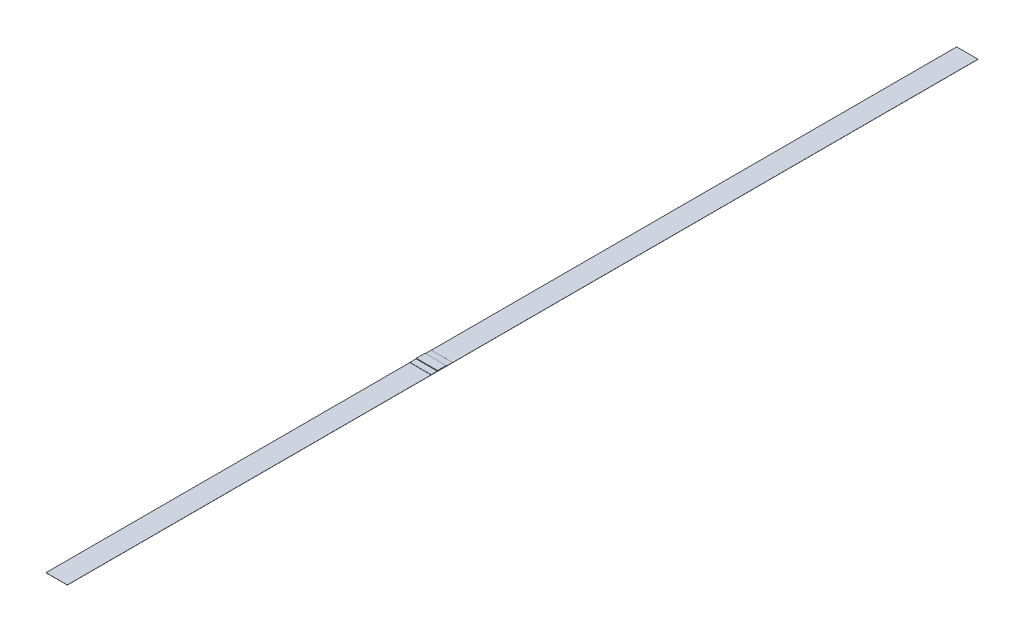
ISO-10303-21;
HEADER;
FILE_DESCRIPTION(('STEP AP214'),'2;1');
FILE_NAME('part.step','',(''),(''),'','','');
FILE_SCHEMA(('AUTOMOTIVE_DESIGN { 1 0 10303 214 1 1 1 1 }'));
ENDSEC;
DATA;
#1=APPLICATION_CONTEXT('core data for automotive mechanical design processes');
#2=APPLICATION_PROTOCOL_DEFINITION('international standard','automotive_design',2000,#1);
#3=PRODUCT_CONTEXT('',#1,'mechanical');
#4=PRODUCT('Part','Part','',(#3));
#5=PRODUCT_RELATED_PRODUCT_CATEGORY('part','',(#4));
#6=PRODUCT_DEFINITION_FORMATION('','',#4);
#7=PRODUCT_DEFINITION_CONTEXT('part definition',#1,'design');
#8=PRODUCT_DEFINITION('design','',#6,#7);
#9=PRODUCT_DEFINITION_SHAPE('','',#8);
#10=(LENGTH_UNIT() NAMED_UNIT(*) SI_UNIT(.MILLI.,.METRE.));
#11=(NAMED_UNIT(*) PLANE_ANGLE_UNIT() SI_UNIT($,.RADIAN.));
#12=(NAMED_UNIT(*) SI_UNIT($,.STERADIAN.) SOLID_ANGLE_UNIT());
#13=UNCERTAINTY_MEASURE_WITH_UNIT(LENGTH_MEASURE(1.E-05),#10,'distance_accuracy_value','');
#14=(GEOMETRIC_REPRESENTATION_CONTEXT(3) GLOBAL_UNCERTAINTY_ASSIGNED_CONTEXT((#13)) GLOBAL_UNIT_ASSIGNED_CONTEXT((#10,
#11,#12)) REPRESENTATION_CONTEXT('',''));
#15=CARTESIAN_POINT('',(0.,0.,0.));
#16=DIRECTION('',(0.,0.,1.));
#17=DIRECTION('',(1.,0.,0.));
#18=AXIS2_PLACEMENT_3D('',#15,#16,#17);
#19=CARTESIAN_POINT('',(0.,0.508,0.));
#20=DIRECTION('',(0.,1.,0.));
#21=DIRECTION('',(0.,0.,1.));
#22=AXIS2_PLACEMENT_3D('',#19,#20,#21);
#23=PLANE('',#22);
#24=DIRECTION('',(0.,0.,-1.));
#25=VECTOR('',#24,1.);
#26=CARTESIAN_POINT('',(66.675,0.508,0.));
#27=LINE('',#26,#25);
#28=CARTESIAN_POINT('',(66.675,0.508,-735.9015));
#29=VERTEX_POINT('',#28);
#30=CARTESIAN_POINT('',(66.675,0.508,-749.7445));
#31=VERTEX_POINT('',#30);
#32=EDGE_CURVE('E287',#29,#31,#27,.T.);
#33=ORIENTED_EDGE('',*,*,#32,.T.);
#34=DIRECTION('',(1.,0.,0.));
#35=VECTOR('',#34,1.);
#36=CARTESIAN_POINT('',(0.,0.508,-749.7445));
#37=LINE('',#36,#35);
#38=CARTESIAN_POINT('',(19.05,0.508,-749.7445));
#39=VERTEX_POINT('',#38);
#40=EDGE_CURVE('E253',#31,#39,#37,.F.);
#41=ORIENTED_EDGE('',*,*,#40,.T.);
#42=DIRECTION('',(0.,0.,1.));
#43=VECTOR('',#42,1.);
#44=CARTESIAN_POINT('',(19.05,0.508,0.));
#45=LINE('',#44,#43);
#46=CARTESIAN_POINT('',(19.05,0.508,-735.9015));
#47=VERTEX_POINT('',#46);
#48=EDGE_CURVE('E224',#39,#47,#45,.T.);
#49=ORIENTED_EDGE('',*,*,#48,.T.);
#50=DIRECTION('',(1.,0.,0.));
#51=VECTOR('',#50,1.);
#52=CARTESIAN_POINT('',(66.675,0.508,-735.9015));
#53=LINE('',#52,#51);
#54=EDGE_CURVE('E201',#47,#29,#53,.T.);
#55=ORIENTED_EDGE('',*,*,#54,.T.);
#56=EDGE_LOOP('',(#33,#41,#49,#55));
#57=FACE_BOUND('',#56,.T.);
#58=ADVANCED_FACE('F37',(#57),#23,.T.);
#59=CARTESIAN_POINT('',(19.05,0.508,-783.2725));
#60=VERTEX_POINT('',#59);
#61=CARTESIAN_POINT('',(19.05,0.508,-769.4295));
#62=VERTEX_POINT('',#61);
#63=EDGE_CURVE('E281',#60,#62,#45,.T.);
#64=ORIENTED_EDGE('',*,*,#63,.T.);
#65=DIRECTION('',(-1.,0.,0.));
#66=VECTOR('',#65,1.);
#67=CARTESIAN_POINT('',(0.,0.508,-769.4295));
#68=LINE('',#67,#66);
#69=CARTESIAN_POINT('',(66.675,0.508,-769.4295));
#70=VERTEX_POINT('',#69);
#71=EDGE_CURVE('E233',#62,#70,#68,.F.);
#72=ORIENTED_EDGE('',*,*,#71,.T.);
#73=CARTESIAN_POINT('',(66.675,0.508,-783.2725));
#74=VERTEX_POINT('',#73);
#75=EDGE_CURVE('E263',#70,#74,#27,.T.);
#76=ORIENTED_EDGE('',*,*,#75,.T.);
#77=DIRECTION('',(1.,0.,0.));
#78=VECTOR('',#77,1.);
#79=CARTESIAN_POINT('',(0.,0.508,-783.2725));
#80=LINE('',#79,#78);
#81=EDGE_CURVE('E204',#74,#60,#80,.F.);
#82=ORIENTED_EDGE('',*,*,#81,.T.);
#83=EDGE_LOOP('',(#64,#72,#76,#82));
#84=FACE_BOUND('',#83,.T.);
#85=ADVANCED_FACE('F284',(#84),#23,.T.);
#86=CARTESIAN_POINT('',(0.,0.254,0.));
#87=DIRECTION('',(0.,1.,0.));
#88=DIRECTION('',(0.,0.,1.));
#89=AXIS2_PLACEMENT_3D('',#86,#87,#88);
#90=PLANE('',#89);
#91=DIRECTION('',(0.,0.,-1.));
#92=VECTOR('',#91,1.);
#93=CARTESIAN_POINT('',(19.05,0.254,0.));
#94=LINE('',#93,#92);
#95=CARTESIAN_POINT('',(19.05,0.254,-783.5265));
#96=VERTEX_POINT('',#95);
#97=CARTESIAN_POINT('',(19.05,0.254,-1955.8));
#98=VERTEX_POINT('',#97);
#99=EDGE_CURVE('E294',#96,#98,#94,.T.);
#100=ORIENTED_EDGE('',*,*,#99,.F.);
#101=DIRECTION('',(1.,0.,0.));
#102=VECTOR('',#101,1.);
#103=CARTESIAN_POINT('',(66.675,0.254,-783.5265));
#104=LINE('',#103,#102);
#105=CARTESIAN_POINT('',(66.675,0.254,-783.5265));
#106=VERTEX_POINT('',#105);
#107=EDGE_CURVE('E187',#96,#106,#104,.T.);
#108=ORIENTED_EDGE('',*,*,#107,.T.);
#109=DIRECTION('',(0.,0.,-1.));
#110=VECTOR('',#109,1.);
#111=CARTESIAN_POINT('',(66.675,0.254,0.));
#112=LINE('',#111,#110);
#113=CARTESIAN_POINT('',(66.675,0.254,-1955.8));
#114=VERTEX_POINT('',#113);
#115=EDGE_CURVE('E173',#106,#114,#112,.T.);
#116=ORIENTED_EDGE('',*,*,#115,.T.);
#117=DIRECTION('',(1.,0.,0.));
#118=VECTOR('',#117,1.);
#119=CARTESIAN_POINT('',(0.,0.254,-1955.8));
#120=LINE('',#119,#118);
#121=EDGE_CURVE('E172',#98,#114,#120,.T.);
#122=ORIENTED_EDGE('',*,*,#121,.F.);
#123=EDGE_LOOP('',(#100,#108,#116,#122));
#124=FACE_BOUND('',#123,.T.);
#125=ADVANCED_FACE('F317',(#124),#90,.T.);
#126=CARTESIAN_POINT('',(0.,0.254,76.2));
#127=DIRECTION('',(0.,0.,-1.));
#128=DIRECTION('',(-1.,0.,0.));
#129=AXIS2_PLACEMENT_3D('',#126,#127,#128);
#130=PLANE('',#129);
#131=DIRECTION('',(1.,0.,0.));
#132=VECTOR('',#131,1.);
#133=CARTESIAN_POINT('',(0.,0.,76.2));
#134=LINE('',#133,#132);
#135=CARTESIAN_POINT('',(19.05,0.,76.2));
#136=VERTEX_POINT('',#135);
#137=CARTESIAN_POINT('',(66.675,0.,76.2));
#138=VERTEX_POINT('',#137);
#139=EDGE_CURVE('E186',#136,#138,#134,.T.);
#140=ORIENTED_EDGE('',*,*,#139,.T.);
#141=DIRECTION('',(0.,-1.,0.));
#142=VECTOR('',#141,1.);
#143=CARTESIAN_POINT('',(66.675,0.254,76.2));
#144=LINE('',#143,#142);
#145=CARTESIAN_POINT('',(66.675,0.254,76.2));
#146=VERTEX_POINT('',#145);
#147=EDGE_CURVE('E166',#146,#138,#144,.T.);
#148=ORIENTED_EDGE('',*,*,#147,.F.);
#149=DIRECTION('',(1.,0.,0.));
#150=VECTOR('',#149,1.);
#151=CARTESIAN_POINT('',(0.,0.254,76.2));
#152=LINE('',#151,#150);
#153=CARTESIAN_POINT('',(19.05,0.254,76.2));
#154=VERTEX_POINT('',#153);
#155=EDGE_CURVE('E177',#154,#146,#152,.T.);
#156=ORIENTED_EDGE('',*,*,#155,.F.);
#157=DIRECTION('',(0.,-1.,0.));
#158=VECTOR('',#157,1.);
#159=CARTESIAN_POINT('',(19.05,0.254,76.2));
#160=LINE('',#159,#158);
#161=EDGE_CURVE('E296',#154,#136,#160,.T.);
#162=ORIENTED_EDGE('',*,*,#161,.T.);
#163=EDGE_LOOP('',(#140,#148,#156,#162));
#164=FACE_BOUND('',#163,.T.);
#165=ADVANCED_FACE('F184',(#164),#130,.F.);
#166=CARTESIAN_POINT('',(66.675,0.254,0.));
#167=DIRECTION('',(-1.,0.,0.));
#168=DIRECTION('',(0.,0.,1.));
#169=AXIS2_PLACEMENT_3D('',#166,#167,#168);
#170=PLANE('',#169);
#171=DIRECTION('',(0.,-1.,0.));
#172=VECTOR('',#171,1.);
#173=CARTESIAN_POINT('',(66.675,1.524,-769.3025));
#174=LINE('',#173,#172);
#175=CARTESIAN_POINT('',(66.675,1.397,-769.3025));
#176=VERTEX_POINT('',#175);
#177=CARTESIAN_POINT('',(66.675,0.635,-769.3025));
#178=VERTEX_POINT('',#177);
#179=EDGE_CURVE('E261',#176,#178,#174,.T.);
#180=ORIENTED_EDGE('',*,*,#179,.F.);
#181=CARTESIAN_POINT('',(66.675,1.397,-769.1755));
#182=DIRECTION('',(-1.,0.,0.));
#183=DIRECTION('',(0.,0.,1.));
#184=AXIS2_PLACEMENT_3D('',#181,#182,#183);
#185=CIRCLE('',#184,0.127);
#186=CARTESIAN_POINT('',(66.675,1.524,-769.1755));
#187=VERTEX_POINT('',#186);
#188=EDGE_CURVE('E247',#176,#187,#185,.F.);
#189=ORIENTED_EDGE('',*,*,#188,.T.);
#190=DIRECTION('',(0.,0.,-1.));
#191=VECTOR('',#190,1.);
#192=CARTESIAN_POINT('',(66.675,1.524,-749.8715));
#193=LINE('',#192,#191);
#194=CARTESIAN_POINT('',(66.675,1.524,-749.9985));
#195=VERTEX_POINT('',#194);
#196=EDGE_CURVE('E458',#195,#187,#193,.T.);
#197=ORIENTED_EDGE('',*,*,#196,.F.);
#198=CARTESIAN_POINT('',(66.675,1.397,-749.9985));
#199=DIRECTION('',(-1.,0.,0.));
#200=DIRECTION('',(0.,0.,1.));
#201=AXIS2_PLACEMENT_3D('',#198,#199,#200);
#202=CIRCLE('',#201,0.127);
#203=CARTESIAN_POINT('',(66.675,1.397,-749.8715));
#204=VERTEX_POINT('',#203);
#205=EDGE_CURVE('E245',#195,#204,#202,.F.);
#206=ORIENTED_EDGE('',*,*,#205,.T.);
#207=DIRECTION('',(0.,-1.,0.));
#208=VECTOR('',#207,1.);
#209=CARTESIAN_POINT('',(66.675,1.524,-749.8715));
#210=LINE('',#209,#208);
#211=CARTESIAN_POINT('',(66.675,0.635,-749.8715));
#212=VERTEX_POINT('',#211);
#213=EDGE_CURVE('E272',#204,#212,#210,.T.);
#214=ORIENTED_EDGE('',*,*,#213,.T.);
#215=CARTESIAN_POINT('',(66.675,0.635,-749.7445));
#216=DIRECTION('',(-1.,0.,0.));
#217=DIRECTION('',(0.,0.,1.));
#218=AXIS2_PLACEMENT_3D('',#215,#216,#217);
#219=CIRCLE('',#218,0.127);
#220=EDGE_CURVE('E45',#212,#31,#219,.T.);
#221=ORIENTED_EDGE('',*,*,#220,.T.);
#222=ORIENTED_EDGE('',*,*,#32,.F.);
#223=CARTESIAN_POINT('',(66.675,0.381,-735.9015));
#224=DIRECTION('',(-1.,0.,0.));
#225=DIRECTION('',(0.,0.,1.));
#226=AXIS2_PLACEMENT_3D('',#223,#224,#225);
#227=CIRCLE('',#226,0.127);
#228=CARTESIAN_POINT('',(66.675,0.381,-735.7745));
#229=VERTEX_POINT('',#228);
#230=EDGE_CURVE('E191',#29,#229,#227,.F.);
#231=ORIENTED_EDGE('',*,*,#230,.T.);
#232=CARTESIAN_POINT('',(66.675,0.381,-735.6475));
#233=DIRECTION('',(-1.,0.,0.));
#234=DIRECTION('',(0.,0.,1.));
#235=AXIS2_PLACEMENT_3D('',#232,#233,#234);
#236=CIRCLE('',#235,0.127);
#237=CARTESIAN_POINT('',(66.675,0.254,-735.6475));
#238=VERTEX_POINT('',#237);
#239=EDGE_CURVE('E169',#229,#238,#236,.T.);
#240=ORIENTED_EDGE('',*,*,#239,.T.);
#241=EDGE_CURVE('E160',#146,#238,#112,.T.);
#242=ORIENTED_EDGE('',*,*,#241,.F.);
#243=ORIENTED_EDGE('',*,*,#147,.T.);
#244=DIRECTION('',(0.,0.,-1.));
#245=VECTOR('',#244,1.);
#246=CARTESIAN_POINT('',(66.675,0.,0.));
#247=LINE('',#246,#245);
#248=CARTESIAN_POINT('',(66.675,0.,-1955.8));
#249=VERTEX_POINT('',#248);
#250=EDGE_CURVE('E298',#138,#249,#247,.T.);
#251=ORIENTED_EDGE('',*,*,#250,.T.);
#252=DIRECTION('',(0.,-1.,0.));
#253=VECTOR('',#252,1.);
#254=CARTESIAN_POINT('',(66.675,0.254,-1955.8));
#255=LINE('',#254,#253);
#256=EDGE_CURVE('E188',#114,#249,#255,.T.);
#257=ORIENTED_EDGE('',*,*,#256,.F.);
#258=ORIENTED_EDGE('',*,*,#115,.F.);
#259=CARTESIAN_POINT('',(66.675,0.381,-783.5265));
#260=DIRECTION('',(-1.,0.,0.));
#261=DIRECTION('',(0.,0.,1.));
#262=AXIS2_PLACEMENT_3D('',#259,#260,#261);
#263=CIRCLE('',#262,0.127);
#264=CARTESIAN_POINT('',(66.675,0.381,-783.3995));
#265=VERTEX_POINT('',#264);
#266=EDGE_CURVE('E213',#106,#265,#263,.T.);
#267=ORIENTED_EDGE('',*,*,#266,.T.);
#268=CARTESIAN_POINT('',(66.675,0.381,-783.2725));
#269=DIRECTION('',(-1.,0.,0.));
#270=DIRECTION('',(0.,0.,1.));
#271=AXIS2_PLACEMENT_3D('',#268,#269,#270);
#272=CIRCLE('',#271,0.127);
#273=EDGE_CURVE('E198',#265,#74,#272,.F.);
#274=ORIENTED_EDGE('',*,*,#273,.T.);
#275=ORIENTED_EDGE('',*,*,#75,.F.);
#276=CARTESIAN_POINT('',(66.675,0.635,-769.4295));
#277=DIRECTION('',(-1.,0.,0.));
#278=DIRECTION('',(0.,0.,1.));
#279=AXIS2_PLACEMENT_3D('',#276,#277,#278);
#280=CIRCLE('',#279,0.127);
#281=EDGE_CURVE('E257',#70,#178,#280,.T.);
#282=ORIENTED_EDGE('',*,*,#281,.T.);
#283=EDGE_LOOP('',(#180,#189,#197,#206,#214,#221,#222,#231,#240,#242,#243,#251,#257,#258,#267,
#274,#275,#282));
#284=FACE_BOUND('',#283,.T.);
#285=ADVANCED_FACE('F163',(#284),#170,.F.);
#286=CARTESIAN_POINT('',(0.,0.254,-1955.8));
#287=DIRECTION('',(0.,0.,-1.));
#288=DIRECTION('',(-1.,0.,0.));
#289=AXIS2_PLACEMENT_3D('',#286,#287,#288);
#290=PLANE('',#289);
#291=DIRECTION('',(1.,0.,0.));
#292=VECTOR('',#291,1.);
#293=CARTESIAN_POINT('',(0.,0.,-1955.8));
#294=LINE('',#293,#292);
#295=CARTESIAN_POINT('',(19.05,0.,-1955.8));
#296=VERTEX_POINT('',#295);
#297=EDGE_CURVE('E300',#296,#249,#294,.T.);
#298=ORIENTED_EDGE('',*,*,#297,.F.);
#299=DIRECTION('',(0.,-1.,0.));
#300=VECTOR('',#299,1.);
#301=CARTESIAN_POINT('',(19.05,0.254,-1955.8));
#302=LINE('',#301,#300);
#303=EDGE_CURVE('E193',#98,#296,#302,.T.);
#304=ORIENTED_EDGE('',*,*,#303,.F.);
#305=ORIENTED_EDGE('',*,*,#121,.T.);
#306=ORIENTED_EDGE('',*,*,#256,.T.);
#307=EDGE_LOOP('',(#298,#304,#305,#306));
#308=FACE_BOUND('',#307,.T.);
#309=ADVANCED_FACE('F311',(#308),#290,.T.);
#310=CARTESIAN_POINT('',(19.05,0.254,0.));
#311=DIRECTION('',(-1.,0.,0.));
#312=DIRECTION('',(0.,0.,1.));
#313=AXIS2_PLACEMENT_3D('',#310,#311,#312);
#314=PLANE('',#313);
#315=DIRECTION('',(0.,0.,1.));
#316=VECTOR('',#315,1.);
#317=CARTESIAN_POINT('',(19.05,1.524,-749.8715));
#318=LINE('',#317,#316);
#319=CARTESIAN_POINT('',(19.05,1.524,-769.1755));
#320=VERTEX_POINT('',#319);
#321=CARTESIAN_POINT('',(19.05,1.524,-749.9985));
#322=VERTEX_POINT('',#321);
#323=EDGE_CURVE('E461',#320,#322,#318,.T.);
#324=ORIENTED_EDGE('',*,*,#323,.F.);
#325=CARTESIAN_POINT('',(19.05,1.397,-769.1755));
#326=DIRECTION('',(-1.,0.,0.));
#327=DIRECTION('',(0.,0.,1.));
#328=AXIS2_PLACEMENT_3D('',#325,#326,#327);
#329=CIRCLE('',#328,0.127);
#330=CARTESIAN_POINT('',(19.05,1.397,-769.3025));
#331=VERTEX_POINT('',#330);
#332=EDGE_CURVE('E243',#320,#331,#329,.T.);
#333=ORIENTED_EDGE('',*,*,#332,.T.);
#334=DIRECTION('',(0.,-1.,0.));
#335=VECTOR('',#334,1.);
#336=CARTESIAN_POINT('',(19.05,1.524,-769.3025));
#337=LINE('',#336,#335);
#338=CARTESIAN_POINT('',(19.05,0.635,-769.3025));
#339=VERTEX_POINT('',#338);
#340=EDGE_CURVE('E273',#331,#339,#337,.T.);
#341=ORIENTED_EDGE('',*,*,#340,.T.);
#342=CARTESIAN_POINT('',(19.05,0.635,-769.4295));
#343=DIRECTION('',(-1.,0.,0.));
#344=DIRECTION('',(0.,0.,1.));
#345=AXIS2_PLACEMENT_3D('',#342,#343,#344);
#346=CIRCLE('',#345,0.127);
#347=EDGE_CURVE('E255',#339,#62,#346,.F.);
#348=ORIENTED_EDGE('',*,*,#347,.T.);
#349=ORIENTED_EDGE('',*,*,#63,.F.);
#350=CARTESIAN_POINT('',(19.05,0.381,-783.2725));
#351=DIRECTION('',(-1.,0.,0.));
#352=DIRECTION('',(0.,0.,1.));
#353=AXIS2_PLACEMENT_3D('',#350,#351,#352);
#354=CIRCLE('',#353,0.127);
#355=CARTESIAN_POINT('',(19.05,0.381,-783.3995));
#356=VERTEX_POINT('',#355);
#357=EDGE_CURVE('E209',#60,#356,#354,.T.);
#358=ORIENTED_EDGE('',*,*,#357,.T.);
#359=CARTESIAN_POINT('',(19.05,0.381,-783.5265));
#360=DIRECTION('',(-1.,0.,0.));
#361=DIRECTION('',(0.,0.,1.));
#362=AXIS2_PLACEMENT_3D('',#359,#360,#361);
#363=CIRCLE('',#362,0.127);
#364=EDGE_CURVE('E215',#356,#96,#363,.F.);
#365=ORIENTED_EDGE('',*,*,#364,.T.);
#366=ORIENTED_EDGE('',*,*,#99,.T.);
#367=ORIENTED_EDGE('',*,*,#303,.T.);
#368=DIRECTION('',(0.,0.,-1.));
#369=VECTOR('',#368,1.);
#370=CARTESIAN_POINT('',(19.05,0.,0.));
#371=LINE('',#370,#369);
#372=EDGE_CURVE('E182',#136,#296,#371,.T.);
#373=ORIENTED_EDGE('',*,*,#372,.F.);
#374=ORIENTED_EDGE('',*,*,#161,.F.);
#375=CARTESIAN_POINT('',(19.05,0.254,-735.6475));
#376=VERTEX_POINT('',#375);
#377=EDGE_CURVE('E180',#154,#376,#94,.T.);
#378=ORIENTED_EDGE('',*,*,#377,.T.);
#379=CARTESIAN_POINT('',(19.05,0.381,-735.6475));
#380=DIRECTION('',(-1.,0.,0.));
#381=DIRECTION('',(0.,0.,1.));
#382=AXIS2_PLACEMENT_3D('',#379,#380,#381);
#383=CIRCLE('',#382,0.127);
#384=CARTESIAN_POINT('',(19.05,0.381,-735.7745));
#385=VERTEX_POINT('',#384);
#386=EDGE_CURVE('E218',#376,#385,#383,.F.);
#387=ORIENTED_EDGE('',*,*,#386,.T.);
#388=CARTESIAN_POINT('',(19.05,0.381,-735.9015));
#389=DIRECTION('',(-1.,0.,0.));
#390=DIRECTION('',(0.,0.,1.));
#391=AXIS2_PLACEMENT_3D('',#388,#389,#390);
#392=CIRCLE('',#391,0.127);
#393=EDGE_CURVE('E206',#385,#47,#392,.T.);
#394=ORIENTED_EDGE('',*,*,#393,.T.);
#395=ORIENTED_EDGE('',*,*,#48,.F.);
#396=CARTESIAN_POINT('',(19.05,0.635,-749.7445));
#397=DIRECTION('',(-1.,0.,0.));
#398=DIRECTION('',(0.,0.,1.));
#399=AXIS2_PLACEMENT_3D('',#396,#397,#398);
#400=CIRCLE('',#399,0.127);
#401=CARTESIAN_POINT('',(19.05,0.635,-749.8715));
#402=VERTEX_POINT('',#401);
#403=EDGE_CURVE('E11',#39,#402,#400,.F.);
#404=ORIENTED_EDGE('',*,*,#403,.T.);
#405=DIRECTION('',(0.,-1.,0.));
#406=VECTOR('',#405,1.);
#407=CARTESIAN_POINT('',(19.05,1.524,-749.8715));
#408=LINE('',#407,#406);
#409=CARTESIAN_POINT('',(19.05,1.397,-749.8715));
#410=VERTEX_POINT('',#409);
#411=EDGE_CURVE('E228',#410,#402,#408,.T.);
#412=ORIENTED_EDGE('',*,*,#411,.F.);
#413=CARTESIAN_POINT('',(19.05,1.397,-749.9985));
#414=DIRECTION('',(-1.,0.,0.));
#415=DIRECTION('',(0.,0.,1.));
#416=AXIS2_PLACEMENT_3D('',#413,#414,#415);
#417=CIRCLE('',#416,0.127);
#418=EDGE_CURVE('E241',#410,#322,#417,.T.);
#419=ORIENTED_EDGE('',*,*,#418,.T.);
#420=EDGE_LOOP('',(#324,#333,#341,#348,#349,#358,#365,#366,#367,#373,#374,#378,#387,#394,#395,
#404,#412,#419));
#421=FACE_BOUND('',#420,.T.);
#422=ADVANCED_FACE('F280',(#421),#314,.T.);
#423=ORIENTED_EDGE('',*,*,#241,.T.);
#424=DIRECTION('',(1.,0.,0.));
#425=VECTOR('',#424,1.);
#426=CARTESIAN_POINT('',(0.,0.254,-735.6475));
#427=LINE('',#426,#425);
#428=EDGE_CURVE('E211',#238,#376,#427,.F.);
#429=ORIENTED_EDGE('',*,*,#428,.T.);
#430=ORIENTED_EDGE('',*,*,#377,.F.);
#431=ORIENTED_EDGE('',*,*,#155,.T.);
#432=EDGE_LOOP('',(#423,#429,#430,#431));
#433=FACE_BOUND('',#432,.T.);
#434=ADVANCED_FACE('F178',(#433),#90,.T.);
#435=CARTESIAN_POINT('',(0.,0.,0.));
#436=DIRECTION('',(0.,1.,0.));
#437=DIRECTION('',(0.,0.,1.));
#438=AXIS2_PLACEMENT_3D('',#435,#436,#437);
#439=PLANE('',#438);
#440=ORIENTED_EDGE('',*,*,#139,.F.);
#441=ORIENTED_EDGE('',*,*,#372,.T.);
#442=ORIENTED_EDGE('',*,*,#297,.T.);
#443=ORIENTED_EDGE('',*,*,#250,.F.);
#444=EDGE_LOOP('',(#440,#441,#442,#443));
#445=FACE_BOUND('',#444,.T.);
#446=ADVANCED_FACE('F314',(#445),#439,.F.);
#447=CARTESIAN_POINT('',(0.,0.381,-783.2725));
#448=DIRECTION('',(1.,0.,0.));
#449=DIRECTION('',(0.,0.,-1.));
#450=AXIS2_PLACEMENT_3D('',#447,#448,#449);
#451=CYLINDRICAL_SURFACE('',#450,0.127);
#452=DIRECTION('',(1.,0.,0.));
#453=VECTOR('',#452,1.);
#454=CARTESIAN_POINT('',(0.,0.381,-783.3995));
#455=LINE('',#454,#453);
#456=EDGE_CURVE('E221',#356,#265,#455,.T.);
#457=ORIENTED_EDGE('',*,*,#456,.F.);
#458=ORIENTED_EDGE('',*,*,#357,.F.);
#459=ORIENTED_EDGE('',*,*,#81,.F.);
#460=ORIENTED_EDGE('',*,*,#273,.F.);
#461=EDGE_LOOP('',(#457,#458,#459,#460));
#462=FACE_BOUND('',#461,.T.);
#463=ADVANCED_FACE('F325',(#462),#451,.T.);
#464=CARTESIAN_POINT('',(0.,0.381,-783.5265));
#465=DIRECTION('',(-1.,0.,0.));
#466=DIRECTION('',(0.,0.,1.));
#467=AXIS2_PLACEMENT_3D('',#464,#465,#466);
#468=CYLINDRICAL_SURFACE('',#467,0.127);
#469=ORIENTED_EDGE('',*,*,#364,.F.);
#470=ORIENTED_EDGE('',*,*,#456,.T.);
#471=ORIENTED_EDGE('',*,*,#266,.F.);
#472=ORIENTED_EDGE('',*,*,#107,.F.);
#473=EDGE_LOOP('',(#469,#470,#471,#472));
#474=FACE_BOUND('',#473,.T.);
#475=ADVANCED_FACE('F321',(#474),#468,.F.);
#476=CARTESIAN_POINT('',(0.,0.381,-735.6475));
#477=DIRECTION('',(1.,0.,0.));
#478=DIRECTION('',(0.,0.,-1.));
#479=AXIS2_PLACEMENT_3D('',#476,#477,#478);
#480=CYLINDRICAL_SURFACE('',#479,0.127);
#481=DIRECTION('',(1.,0.,0.));
#482=VECTOR('',#481,1.);
#483=CARTESIAN_POINT('',(0.,0.381,-735.7745));
#484=LINE('',#483,#482);
#485=EDGE_CURVE('E225',#385,#229,#484,.T.);
#486=ORIENTED_EDGE('',*,*,#485,.F.);
#487=ORIENTED_EDGE('',*,*,#386,.F.);
#488=ORIENTED_EDGE('',*,*,#428,.F.);
#489=ORIENTED_EDGE('',*,*,#239,.F.);
#490=EDGE_LOOP('',(#486,#487,#488,#489));
#491=FACE_BOUND('',#490,.T.);
#492=ADVANCED_FACE('F332',(#491),#480,.F.);
#493=CARTESIAN_POINT('',(0.,0.381,-735.9015));
#494=DIRECTION('',(-1.,0.,0.));
#495=DIRECTION('',(0.,0.,1.));
#496=AXIS2_PLACEMENT_3D('',#493,#494,#495);
#497=CYLINDRICAL_SURFACE('',#496,0.127);
#498=ORIENTED_EDGE('',*,*,#393,.F.);
#499=ORIENTED_EDGE('',*,*,#485,.T.);
#500=ORIENTED_EDGE('',*,*,#230,.F.);
#501=ORIENTED_EDGE('',*,*,#54,.F.);
#502=EDGE_LOOP('',(#498,#499,#500,#501));
#503=FACE_BOUND('',#502,.T.);
#504=ADVANCED_FACE('F393',(#503),#497,.T.);
#505=CARTESIAN_POINT('',(19.05,1.524,-749.8715));
#506=DIRECTION('',(0.,0.,-1.));
#507=DIRECTION('',(-1.,0.,0.));
#508=AXIS2_PLACEMENT_3D('',#505,#506,#507);
#509=PLANE('',#508);
#510=ORIENTED_EDGE('',*,*,#213,.F.);
#511=DIRECTION('',(1.,0.,0.));
#512=VECTOR('',#511,1.);
#513=CARTESIAN_POINT('',(19.05,1.397,-749.8715));
#514=LINE('',#513,#512);
#515=EDGE_CURVE('E251',#204,#410,#514,.F.);
#516=ORIENTED_EDGE('',*,*,#515,.T.);
#517=ORIENTED_EDGE('',*,*,#411,.T.);
#518=DIRECTION('',(1.,0.,0.));
#519=VECTOR('',#518,1.);
#520=CARTESIAN_POINT('',(19.05,0.635,-749.8715));
#521=LINE('',#520,#519);
#522=EDGE_CURVE('E249',#402,#212,#521,.T.);
#523=ORIENTED_EDGE('',*,*,#522,.T.);
#524=EDGE_LOOP('',(#510,#516,#517,#523));
#525=FACE_BOUND('',#524,.T.);
#526=ADVANCED_FACE('F344',(#525),#509,.F.);
#527=CARTESIAN_POINT('',(19.05,1.524,-769.3025));
#528=DIRECTION('',(0.,0.,1.));
#529=DIRECTION('',(1.,0.,0.));
#530=AXIS2_PLACEMENT_3D('',#527,#528,#529);
#531=PLANE('',#530);
#532=ORIENTED_EDGE('',*,*,#179,.T.);
#533=DIRECTION('',(-1.,0.,0.));
#534=VECTOR('',#533,1.);
#535=CARTESIAN_POINT('',(19.05,0.635,-769.3025));
#536=LINE('',#535,#534);
#537=EDGE_CURVE('E230',#178,#339,#536,.T.);
#538=ORIENTED_EDGE('',*,*,#537,.T.);
#539=ORIENTED_EDGE('',*,*,#340,.F.);
#540=DIRECTION('',(-1.,0.,0.));
#541=VECTOR('',#540,1.);
#542=CARTESIAN_POINT('',(19.05,1.397,-769.3025));
#543=LINE('',#542,#541);
#544=EDGE_CURVE('E220',#331,#176,#543,.F.);
#545=ORIENTED_EDGE('',*,*,#544,.T.);
#546=EDGE_LOOP('',(#532,#538,#539,#545));
#547=FACE_BOUND('',#546,.T.);
#548=ADVANCED_FACE('F268',(#547),#531,.F.);
#549=CARTESIAN_POINT('',(0.,1.524,0.));
#550=DIRECTION('',(0.,-1.,0.));
#551=DIRECTION('',(0.,0.,-1.));
#552=AXIS2_PLACEMENT_3D('',#549,#550,#551);
#553=PLANE('',#552);
#554=ORIENTED_EDGE('',*,*,#196,.T.);
#555=DIRECTION('',(-1.,0.,0.));
#556=VECTOR('',#555,1.);
#557=CARTESIAN_POINT('',(0.,1.524,-769.1755));
#558=LINE('',#557,#556);
#559=EDGE_CURVE('E238',#187,#320,#558,.T.);
#560=ORIENTED_EDGE('',*,*,#559,.T.);
#561=ORIENTED_EDGE('',*,*,#323,.T.);
#562=DIRECTION('',(1.,0.,0.));
#563=VECTOR('',#562,1.);
#564=CARTESIAN_POINT('',(0.,1.524,-749.9985));
#565=LINE('',#564,#563);
#566=EDGE_CURVE('E235',#322,#195,#565,.T.);
#567=ORIENTED_EDGE('',*,*,#566,.T.);
#568=EDGE_LOOP('',(#554,#560,#561,#567));
#569=FACE_BOUND('',#568,.T.);
#570=ADVANCED_FACE('F403',(#569),#553,.F.);
#571=CARTESIAN_POINT('',(19.05,0.635,-769.4295));
#572=DIRECTION('',(-1.,0.,0.));
#573=DIRECTION('',(0.,0.,1.));
#574=AXIS2_PLACEMENT_3D('',#571,#572,#573);
#575=CYLINDRICAL_SURFACE('',#574,0.127);
#576=ORIENTED_EDGE('',*,*,#281,.F.);
#577=ORIENTED_EDGE('',*,*,#71,.F.);
#578=ORIENTED_EDGE('',*,*,#347,.F.);
#579=ORIENTED_EDGE('',*,*,#537,.F.);
#580=EDGE_LOOP('',(#576,#577,#578,#579));
#581=FACE_BOUND('',#580,.T.);
#582=ADVANCED_FACE('F275',(#581),#575,.F.);
#583=CARTESIAN_POINT('',(0.,1.397,-769.1755));
#584=DIRECTION('',(-1.,0.,0.));
#585=DIRECTION('',(0.,0.,1.));
#586=AXIS2_PLACEMENT_3D('',#583,#584,#585);
#587=CYLINDRICAL_SURFACE('',#586,0.127);
#588=ORIENTED_EDGE('',*,*,#188,.F.);
#589=ORIENTED_EDGE('',*,*,#544,.F.);
#590=ORIENTED_EDGE('',*,*,#332,.F.);
#591=ORIENTED_EDGE('',*,*,#559,.F.);
#592=EDGE_LOOP('',(#588,#589,#590,#591));
#593=FACE_BOUND('',#592,.T.);
#594=ADVANCED_FACE('F420',(#593),#587,.T.);
#595=CARTESIAN_POINT('',(0.,1.397,-749.9985));
#596=DIRECTION('',(1.,0.,0.));
#597=DIRECTION('',(0.,0.,-1.));
#598=AXIS2_PLACEMENT_3D('',#595,#596,#597);
#599=CYLINDRICAL_SURFACE('',#598,0.127);
#600=ORIENTED_EDGE('',*,*,#418,.F.);
#601=ORIENTED_EDGE('',*,*,#515,.F.);
#602=ORIENTED_EDGE('',*,*,#205,.F.);
#603=ORIENTED_EDGE('',*,*,#566,.F.);
#604=EDGE_LOOP('',(#600,#601,#602,#603));
#605=FACE_BOUND('',#604,.T.);
#606=ADVANCED_FACE('F429',(#605),#599,.T.);
#607=CARTESIAN_POINT('',(19.05,0.635,-749.7445));
#608=DIRECTION('',(1.,0.,0.));
#609=DIRECTION('',(0.,0.,-1.));
#610=AXIS2_PLACEMENT_3D('',#607,#608,#609);
#611=CYLINDRICAL_SURFACE('',#610,0.127);
#612=ORIENTED_EDGE('',*,*,#403,.F.);
#613=ORIENTED_EDGE('',*,*,#40,.F.);
#614=ORIENTED_EDGE('',*,*,#220,.F.);
#615=ORIENTED_EDGE('',*,*,#522,.F.);
#616=EDGE_LOOP('',(#612,#613,#614,#615));
#617=FACE_BOUND('',#616,.T.);
#618=ADVANCED_FACE('F39',(#617),#611,.F.);
#619=CLOSED_SHELL('',(#58,#85,#125,#165,#285,#309,#422,#434,#446,#463,#475,#492,#504,#526,#548,
#570,#582,#594,#606,#618));
#620=MANIFOLD_SOLID_BREP('B2',#619);
#621=ADVANCED_BREP_SHAPE_REPRESENTATION('',(#18,#620),#14);
#622=SHAPE_DEFINITION_REPRESENTATION(#9,#621);
ENDSEC;
END-ISO-10303-21;
